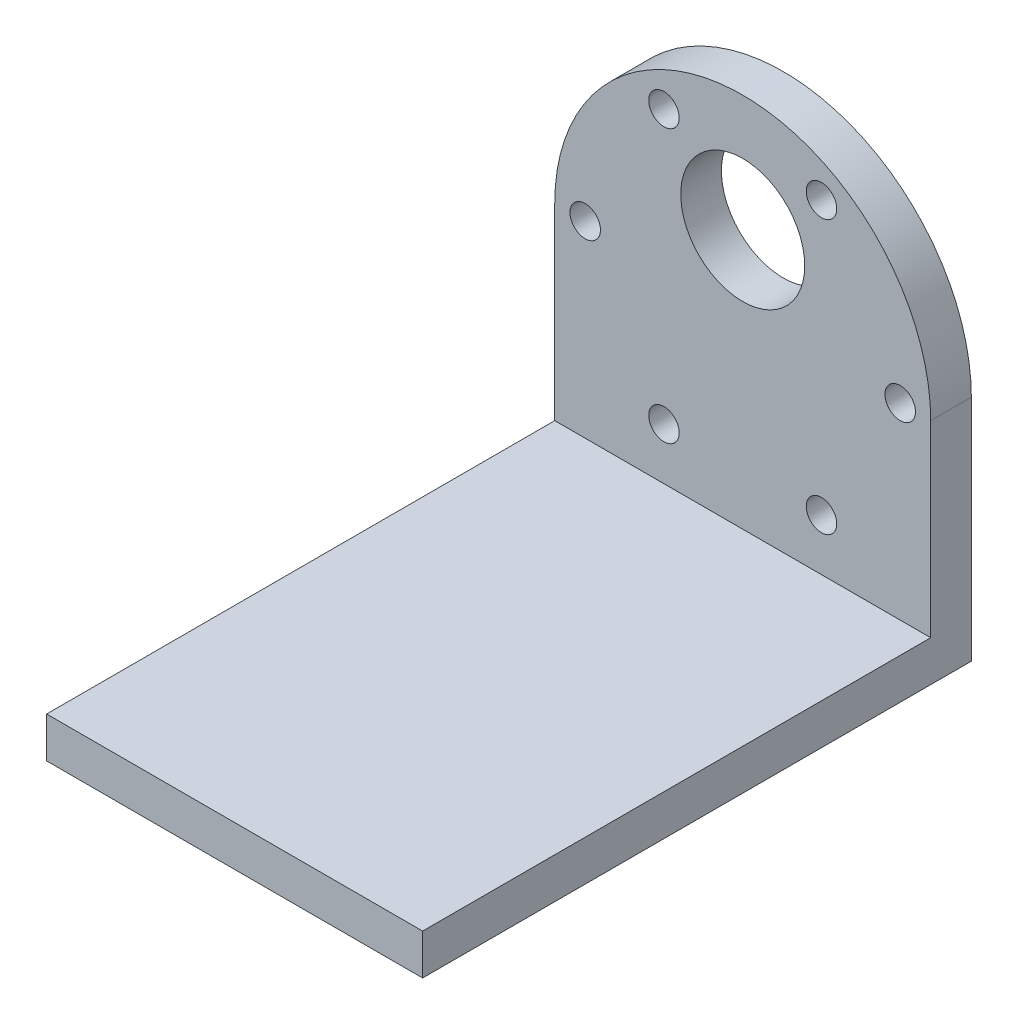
ISO-10303-21;
HEADER;
FILE_DESCRIPTION(('STEP AP214'),'2;1');
FILE_NAME('part.step','',(''),(''),'','','');
FILE_SCHEMA(('AUTOMOTIVE_DESIGN { 1 0 10303 214 1 1 1 1 }'));
ENDSEC;
DATA;
#1=APPLICATION_CONTEXT('core data for automotive mechanical design processes');
#2=APPLICATION_PROTOCOL_DEFINITION('international standard','automotive_design',2000,#1);
#3=PRODUCT_CONTEXT('',#1,'mechanical');
#4=PRODUCT('Part','Part','',(#3));
#5=PRODUCT_RELATED_PRODUCT_CATEGORY('part','',(#4));
#6=PRODUCT_DEFINITION_FORMATION('','',#4);
#7=PRODUCT_DEFINITION_CONTEXT('part definition',#1,'design');
#8=PRODUCT_DEFINITION('design','',#6,#7);
#9=PRODUCT_DEFINITION_SHAPE('','',#8);
#10=(LENGTH_UNIT() NAMED_UNIT(*) SI_UNIT(.MILLI.,.METRE.));
#11=(NAMED_UNIT(*) PLANE_ANGLE_UNIT() SI_UNIT($,.RADIAN.));
#12=(NAMED_UNIT(*) SI_UNIT($,.STERADIAN.) SOLID_ANGLE_UNIT());
#13=UNCERTAINTY_MEASURE_WITH_UNIT(LENGTH_MEASURE(1.E-05),#10,'distance_accuracy_value','');
#14=(GEOMETRIC_REPRESENTATION_CONTEXT(3) GLOBAL_UNCERTAINTY_ASSIGNED_CONTEXT((#13)) GLOBAL_UNIT_ASSIGNED_CONTEXT((#10,
#11,#12)) REPRESENTATION_CONTEXT('',''));
#15=CARTESIAN_POINT('',(0.,0.,0.));
#16=DIRECTION('',(0.,0.,1.));
#17=DIRECTION('',(1.,0.,0.));
#18=AXIS2_PLACEMENT_3D('',#15,#16,#17);
#19=CARTESIAN_POINT('',(18.5,22.5,4.));
#20=DIRECTION('',(0.,0.,1.));
#21=DIRECTION('',(1.,0.,0.));
#22=AXIS2_PLACEMENT_3D('',#19,#20,#21);
#23=PLANE('',#22);
#24=DIRECTION('',(-1.,0.,0.));
#25=VECTOR('',#24,1.);
#26=CARTESIAN_POINT('',(0.,4.,4.));
#27=LINE('',#26,#25);
#28=CARTESIAN_POINT('',(37.,4.,4.));
#29=VERTEX_POINT('',#28);
#30=CARTESIAN_POINT('',(0.,4.,4.));
#31=VERTEX_POINT('',#30);
#32=EDGE_CURVE('E61',#29,#31,#27,.T.);
#33=ORIENTED_EDGE('',*,*,#32,.F.);
#34=DIRECTION('',(0.,1.,0.));
#35=VECTOR('',#34,1.);
#36=CARTESIAN_POINT('',(37.,0.,4.));
#37=LINE('',#36,#35);
#38=CARTESIAN_POINT('',(37.,22.5,4.));
#39=VERTEX_POINT('',#38);
#40=EDGE_CURVE('E66',#29,#39,#37,.T.);
#41=ORIENTED_EDGE('',*,*,#40,.T.);
#42=CARTESIAN_POINT('',(18.5,22.5,4.));
#43=DIRECTION('',(0.,0.,1.));
#44=DIRECTION('',(1.,0.,0.));
#45=AXIS2_PLACEMENT_3D('',#42,#43,#44);
#46=CIRCLE('',#45,18.5);
#47=CARTESIAN_POINT('',(0.,22.5,4.));
#48=VERTEX_POINT('',#47);
#49=EDGE_CURVE('E98',#39,#48,#46,.T.);
#50=ORIENTED_EDGE('',*,*,#49,.T.);
#51=DIRECTION('',(0.,-1.,0.));
#52=VECTOR('',#51,1.);
#53=CARTESIAN_POINT('',(0.,22.5,4.));
#54=LINE('',#53,#52);
#55=EDGE_CURVE('E221',#48,#31,#54,.T.);
#56=ORIENTED_EDGE('',*,*,#55,.T.);
#57=EDGE_LOOP('',(#33,#41,#50,#56));
#58=FACE_BOUND('',#57,.T.);
#59=CARTESIAN_POINT('',(26.2500000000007,9.07660624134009,4.));
#60=DIRECTION('',(0.,0.,1.));
#61=DIRECTION('',(1.,0.,0.));
#62=AXIS2_PLACEMENT_3D('',#59,#60,#61);
#63=CIRCLE('',#62,1.50000000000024);
#64=CARTESIAN_POINT('',(27.7500000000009,9.07660624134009,4.));
#65=VERTEX_POINT('',#64);
#66=EDGE_CURVE('E178',#65,#65,#63,.T.);
#67=ORIENTED_EDGE('',*,*,#66,.F.);
#68=EDGE_LOOP('',(#67));
#69=FACE_BOUND('',#68,.T.);
#70=CARTESIAN_POINT('',(18.5,29.5,4.));
#71=DIRECTION('',(0.,0.,1.));
#72=DIRECTION('',(1.,0.,0.));
#73=AXIS2_PLACEMENT_3D('',#70,#71,#72);
#74=CIRCLE('',#73,6.1);
#75=CARTESIAN_POINT('',(24.6,29.5,4.));
#76=VERTEX_POINT('',#75);
#77=EDGE_CURVE('E194',#76,#76,#74,.T.);
#78=ORIENTED_EDGE('',*,*,#77,.F.);
#79=EDGE_LOOP('',(#78));
#80=FACE_BOUND('',#79,.T.);
#81=CARTESIAN_POINT('',(2.99999999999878,22.5,4.));
#82=DIRECTION('',(0.,0.,1.));
#83=DIRECTION('',(1.,0.,0.));
#84=AXIS2_PLACEMENT_3D('',#81,#82,#83);
#85=CIRCLE('',#84,1.50000000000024);
#86=CARTESIAN_POINT('',(4.49999999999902,22.5,4.));
#87=VERTEX_POINT('',#86);
#88=EDGE_CURVE('E210',#87,#87,#85,.T.);
#89=ORIENTED_EDGE('',*,*,#88,.F.);
#90=EDGE_LOOP('',(#89));
#91=FACE_BOUND('',#90,.T.);
#92=CARTESIAN_POINT('',(10.7499999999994,35.9233937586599,4.));
#93=DIRECTION('',(0.,0.,1.));
#94=DIRECTION('',(1.,0.,0.));
#95=AXIS2_PLACEMENT_3D('',#92,#93,#94);
#96=CIRCLE('',#95,1.50000000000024);
#97=CARTESIAN_POINT('',(12.2499999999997,35.9233937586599,4.));
#98=VERTEX_POINT('',#97);
#99=EDGE_CURVE('E111',#98,#98,#96,.T.);
#100=ORIENTED_EDGE('',*,*,#99,.F.);
#101=EDGE_LOOP('',(#100));
#102=FACE_BOUND('',#101,.T.);
#103=CARTESIAN_POINT('',(26.2500000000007,35.9233937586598,4.));
#104=DIRECTION('',(0.,0.,1.));
#105=DIRECTION('',(1.,0.,0.));
#106=AXIS2_PLACEMENT_3D('',#103,#104,#105);
#107=CIRCLE('',#106,1.50000000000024);
#108=CARTESIAN_POINT('',(27.7500000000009,35.9233937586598,4.));
#109=VERTEX_POINT('',#108);
#110=EDGE_CURVE('E202',#109,#109,#107,.T.);
#111=ORIENTED_EDGE('',*,*,#110,.F.);
#112=EDGE_LOOP('',(#111));
#113=FACE_BOUND('',#112,.T.);
#114=CARTESIAN_POINT('',(34.0000000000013,22.5,4.));
#115=DIRECTION('',(0.,0.,1.));
#116=DIRECTION('',(1.,0.,0.));
#117=AXIS2_PLACEMENT_3D('',#114,#115,#116);
#118=CIRCLE('',#117,1.50000000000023);
#119=CARTESIAN_POINT('',(35.5000000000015,22.5,4.));
#120=VERTEX_POINT('',#119);
#121=EDGE_CURVE('E186',#120,#120,#118,.T.);
#122=ORIENTED_EDGE('',*,*,#121,.F.);
#123=EDGE_LOOP('',(#122));
#124=FACE_BOUND('',#123,.T.);
#125=CARTESIAN_POINT('',(10.7499999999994,9.07660624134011,4.));
#126=DIRECTION('',(0.,0.,1.));
#127=DIRECTION('',(1.,0.,0.));
#128=AXIS2_PLACEMENT_3D('',#125,#126,#127);
#129=CIRCLE('',#128,1.50000000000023);
#130=CARTESIAN_POINT('',(12.2499999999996,9.07660624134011,4.));
#131=VERTEX_POINT('',#130);
#132=EDGE_CURVE('E170',#131,#131,#129,.T.);
#133=ORIENTED_EDGE('',*,*,#132,.F.);
#134=EDGE_LOOP('',(#133));
#135=FACE_BOUND('',#134,.T.);
#136=ADVANCED_FACE('F45',(#58,#69,#80,#91,#102,#113,#124,#135),#23,.T.);
#137=CARTESIAN_POINT('',(18.5,22.5,0.));
#138=DIRECTION('',(0.,0.,1.));
#139=DIRECTION('',(1.,0.,0.));
#140=AXIS2_PLACEMENT_3D('',#137,#138,#139);
#141=PLANE('',#140);
#142=CARTESIAN_POINT('',(18.5,22.5,0.));
#143=DIRECTION('',(0.,0.,1.));
#144=DIRECTION('',(1.,0.,0.));
#145=AXIS2_PLACEMENT_3D('',#142,#143,#144);
#146=CIRCLE('',#145,18.5);
#147=CARTESIAN_POINT('',(37.,22.5,0.));
#148=VERTEX_POINT('',#147);
#149=CARTESIAN_POINT('',(0.,22.5,0.));
#150=VERTEX_POINT('',#149);
#151=EDGE_CURVE('E104',#148,#150,#146,.T.);
#152=ORIENTED_EDGE('',*,*,#151,.F.);
#153=DIRECTION('',(0.,1.,0.));
#154=VECTOR('',#153,1.);
#155=CARTESIAN_POINT('',(37.,0.,0.));
#156=LINE('',#155,#154);
#157=CARTESIAN_POINT('',(37.,0.,0.));
#158=VERTEX_POINT('',#157);
#159=EDGE_CURVE('E86',#158,#148,#156,.T.);
#160=ORIENTED_EDGE('',*,*,#159,.F.);
#161=DIRECTION('',(1.,0.,0.));
#162=VECTOR('',#161,1.);
#163=CARTESIAN_POINT('',(0.,0.,0.));
#164=LINE('',#163,#162);
#165=CARTESIAN_POINT('',(0.,0.,0.));
#166=VERTEX_POINT('',#165);
#167=EDGE_CURVE('E99',#166,#158,#164,.T.);
#168=ORIENTED_EDGE('',*,*,#167,.F.);
#169=DIRECTION('',(0.,-1.,0.));
#170=VECTOR('',#169,1.);
#171=CARTESIAN_POINT('',(0.,22.5,0.));
#172=LINE('',#171,#170);
#173=EDGE_CURVE('E109',#150,#166,#172,.T.);
#174=ORIENTED_EDGE('',*,*,#173,.F.);
#175=EDGE_LOOP('',(#152,#160,#168,#174));
#176=FACE_BOUND('',#175,.T.);
#177=CARTESIAN_POINT('',(10.7499999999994,35.9233937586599,0.));
#178=DIRECTION('',(0.,0.,1.));
#179=DIRECTION('',(1.,0.,0.));
#180=AXIS2_PLACEMENT_3D('',#177,#178,#179);
#181=CIRCLE('',#180,1.50000000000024);
#182=CARTESIAN_POINT('',(12.2499999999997,35.9233937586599,0.));
#183=VERTEX_POINT('',#182);
#184=EDGE_CURVE('E117',#183,#183,#181,.T.);
#185=ORIENTED_EDGE('',*,*,#184,.T.);
#186=EDGE_LOOP('',(#185));
#187=FACE_BOUND('',#186,.T.);
#188=CARTESIAN_POINT('',(2.99999999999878,22.5,0.));
#189=DIRECTION('',(0.,0.,1.));
#190=DIRECTION('',(1.,0.,0.));
#191=AXIS2_PLACEMENT_3D('',#188,#189,#190);
#192=CIRCLE('',#191,1.50000000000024);
#193=CARTESIAN_POINT('',(4.49999999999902,22.5,0.));
#194=VERTEX_POINT('',#193);
#195=EDGE_CURVE('E206',#194,#194,#192,.T.);
#196=ORIENTED_EDGE('',*,*,#195,.T.);
#197=EDGE_LOOP('',(#196));
#198=FACE_BOUND('',#197,.T.);
#199=CARTESIAN_POINT('',(26.2500000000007,35.9233937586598,0.));
#200=DIRECTION('',(0.,0.,1.));
#201=DIRECTION('',(1.,0.,0.));
#202=AXIS2_PLACEMENT_3D('',#199,#200,#201);
#203=CIRCLE('',#202,1.50000000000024);
#204=CARTESIAN_POINT('',(27.7500000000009,35.9233937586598,0.));
#205=VERTEX_POINT('',#204);
#206=EDGE_CURVE('E198',#205,#205,#203,.T.);
#207=ORIENTED_EDGE('',*,*,#206,.T.);
#208=EDGE_LOOP('',(#207));
#209=FACE_BOUND('',#208,.T.);
#210=CARTESIAN_POINT('',(18.5,29.5,0.));
#211=DIRECTION('',(0.,0.,1.));
#212=DIRECTION('',(1.,0.,0.));
#213=AXIS2_PLACEMENT_3D('',#210,#211,#212);
#214=CIRCLE('',#213,6.1);
#215=CARTESIAN_POINT('',(24.6,29.5,0.));
#216=VERTEX_POINT('',#215);
#217=EDGE_CURVE('E190',#216,#216,#214,.T.);
#218=ORIENTED_EDGE('',*,*,#217,.T.);
#219=EDGE_LOOP('',(#218));
#220=FACE_BOUND('',#219,.T.);
#221=CARTESIAN_POINT('',(34.0000000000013,22.5,0.));
#222=DIRECTION('',(0.,0.,1.));
#223=DIRECTION('',(1.,0.,0.));
#224=AXIS2_PLACEMENT_3D('',#221,#222,#223);
#225=CIRCLE('',#224,1.50000000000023);
#226=CARTESIAN_POINT('',(35.5000000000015,22.5,0.));
#227=VERTEX_POINT('',#226);
#228=EDGE_CURVE('E182',#227,#227,#225,.T.);
#229=ORIENTED_EDGE('',*,*,#228,.T.);
#230=EDGE_LOOP('',(#229));
#231=FACE_BOUND('',#230,.T.);
#232=CARTESIAN_POINT('',(26.2500000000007,9.07660624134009,0.));
#233=DIRECTION('',(0.,0.,1.));
#234=DIRECTION('',(1.,0.,0.));
#235=AXIS2_PLACEMENT_3D('',#232,#233,#234);
#236=CIRCLE('',#235,1.50000000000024);
#237=CARTESIAN_POINT('',(27.7500000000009,9.07660624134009,0.));
#238=VERTEX_POINT('',#237);
#239=EDGE_CURVE('E174',#238,#238,#236,.T.);
#240=ORIENTED_EDGE('',*,*,#239,.T.);
#241=EDGE_LOOP('',(#240));
#242=FACE_BOUND('',#241,.T.);
#243=CARTESIAN_POINT('',(10.7499999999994,9.07660624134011,0.));
#244=DIRECTION('',(0.,0.,1.));
#245=DIRECTION('',(1.,0.,0.));
#246=AXIS2_PLACEMENT_3D('',#243,#244,#245);
#247=CIRCLE('',#246,1.50000000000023);
#248=CARTESIAN_POINT('',(12.2499999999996,9.07660624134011,0.));
#249=VERTEX_POINT('',#248);
#250=EDGE_CURVE('E166',#249,#249,#247,.T.);
#251=ORIENTED_EDGE('',*,*,#250,.T.);
#252=EDGE_LOOP('',(#251));
#253=FACE_BOUND('',#252,.T.);
#254=ADVANCED_FACE('F107',(#176,#187,#198,#209,#220,#231,#242,#253),#141,.F.);
#255=CARTESIAN_POINT('',(18.5,22.5,4.));
#256=DIRECTION('',(0.,0.,-1.));
#257=DIRECTION('',(-1.,0.,0.));
#258=AXIS2_PLACEMENT_3D('',#255,#256,#257);
#259=CYLINDRICAL_SURFACE('',#258,18.5);
#260=ORIENTED_EDGE('',*,*,#151,.T.);
#261=DIRECTION('',(0.,0.,-1.));
#262=VECTOR('',#261,1.);
#263=CARTESIAN_POINT('',(0.,22.5,4.));
#264=LINE('',#263,#262);
#265=EDGE_CURVE('E11',#48,#150,#264,.T.);
#266=ORIENTED_EDGE('',*,*,#265,.F.);
#267=ORIENTED_EDGE('',*,*,#49,.F.);
#268=DIRECTION('',(0.,0.,-1.));
#269=VECTOR('',#268,1.);
#270=CARTESIAN_POINT('',(37.,22.5,4.));
#271=LINE('',#270,#269);
#272=EDGE_CURVE('E89',#39,#148,#271,.T.);
#273=ORIENTED_EDGE('',*,*,#272,.T.);
#274=EDGE_LOOP('',(#260,#266,#267,#273));
#275=FACE_BOUND('',#274,.T.);
#276=ADVANCED_FACE('F47',(#275),#259,.T.);
#277=CARTESIAN_POINT('',(0.,22.5,4.));
#278=DIRECTION('',(1.,0.,0.));
#279=DIRECTION('',(0.,1.,0.));
#280=AXIS2_PLACEMENT_3D('',#277,#278,#279);
#281=PLANE('',#280);
#282=ORIENTED_EDGE('',*,*,#173,.T.);
#283=DIRECTION('',(0.,0.,-1.));
#284=VECTOR('',#283,1.);
#285=CARTESIAN_POINT('',(0.,0.,4.));
#286=LINE('',#285,#284);
#287=CARTESIAN_POINT('',(0.,0.,54.));
#288=VERTEX_POINT('',#287);
#289=EDGE_CURVE('E54',#288,#166,#286,.T.);
#290=ORIENTED_EDGE('',*,*,#289,.F.);
#291=DIRECTION('',(0.,-1.,0.));
#292=VECTOR('',#291,1.);
#293=CARTESIAN_POINT('',(0.,0.,54.));
#294=LINE('',#293,#292);
#295=CARTESIAN_POINT('',(0.,4.,54.));
#296=VERTEX_POINT('',#295);
#297=EDGE_CURVE('E139',#296,#288,#294,.T.);
#298=ORIENTED_EDGE('',*,*,#297,.F.);
#299=DIRECTION('',(0.,0.,-1.));
#300=VECTOR('',#299,1.);
#301=CARTESIAN_POINT('',(0.,4.,54.));
#302=LINE('',#301,#300);
#303=EDGE_CURVE('E159',#296,#31,#302,.T.);
#304=ORIENTED_EDGE('',*,*,#303,.T.);
#305=ORIENTED_EDGE('',*,*,#55,.F.);
#306=ORIENTED_EDGE('',*,*,#265,.T.);
#307=EDGE_LOOP('',(#282,#290,#298,#304,#305,#306));
#308=FACE_BOUND('',#307,.T.);
#309=ADVANCED_FACE('F137',(#308),#281,.F.);
#310=CARTESIAN_POINT('',(0.,0.,4.));
#311=DIRECTION('',(0.,1.,0.));
#312=DIRECTION('',(0.,0.,1.));
#313=AXIS2_PLACEMENT_3D('',#310,#311,#312);
#314=PLANE('',#313);
#315=ORIENTED_EDGE('',*,*,#167,.T.);
#316=DIRECTION('',(0.,0.,-1.));
#317=VECTOR('',#316,1.);
#318=CARTESIAN_POINT('',(37.,0.,4.));
#319=LINE('',#318,#317);
#320=CARTESIAN_POINT('',(37.,0.,54.));
#321=VERTEX_POINT('',#320);
#322=EDGE_CURVE('E93',#321,#158,#319,.T.);
#323=ORIENTED_EDGE('',*,*,#322,.F.);
#324=DIRECTION('',(1.,0.,0.));
#325=VECTOR('',#324,1.);
#326=CARTESIAN_POINT('',(0.,0.,54.));
#327=LINE('',#326,#325);
#328=EDGE_CURVE('E133',#288,#321,#327,.T.);
#329=ORIENTED_EDGE('',*,*,#328,.F.);
#330=ORIENTED_EDGE('',*,*,#289,.T.);
#331=EDGE_LOOP('',(#315,#323,#329,#330));
#332=FACE_BOUND('',#331,.T.);
#333=ADVANCED_FACE('F130',(#332),#314,.F.);
#334=CARTESIAN_POINT('',(37.,0.,4.));
#335=DIRECTION('',(-1.,0.,0.));
#336=DIRECTION('',(0.,-1.,0.));
#337=AXIS2_PLACEMENT_3D('',#334,#335,#336);
#338=PLANE('',#337);
#339=ORIENTED_EDGE('',*,*,#159,.T.);
#340=ORIENTED_EDGE('',*,*,#272,.F.);
#341=ORIENTED_EDGE('',*,*,#40,.F.);
#342=DIRECTION('',(0.,0.,-1.));
#343=VECTOR('',#342,1.);
#344=CARTESIAN_POINT('',(37.,4.,54.));
#345=LINE('',#344,#343);
#346=CARTESIAN_POINT('',(37.,4.,54.));
#347=VERTEX_POINT('',#346);
#348=EDGE_CURVE('E163',#347,#29,#345,.T.);
#349=ORIENTED_EDGE('',*,*,#348,.F.);
#350=DIRECTION('',(0.,1.,0.));
#351=VECTOR('',#350,1.);
#352=CARTESIAN_POINT('',(37.,0.,54.));
#353=LINE('',#352,#351);
#354=EDGE_CURVE('E154',#321,#347,#353,.T.);
#355=ORIENTED_EDGE('',*,*,#354,.F.);
#356=ORIENTED_EDGE('',*,*,#322,.T.);
#357=EDGE_LOOP('',(#339,#340,#341,#349,#355,#356));
#358=FACE_BOUND('',#357,.T.);
#359=ADVANCED_FACE('F88',(#358),#338,.F.);
#360=CARTESIAN_POINT('',(10.7499999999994,35.9233937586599,4.));
#361=DIRECTION('',(0.,0.,-1.));
#362=DIRECTION('',(-1.,0.,0.));
#363=AXIS2_PLACEMENT_3D('',#360,#361,#362);
#364=CYLINDRICAL_SURFACE('',#363,1.50000000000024);
#365=ORIENTED_EDGE('',*,*,#99,.T.);
#366=EDGE_LOOP('',(#365));
#367=FACE_BOUND('',#366,.T.);
#368=ORIENTED_EDGE('',*,*,#184,.F.);
#369=EDGE_LOOP('',(#368));
#370=FACE_BOUND('',#369,.T.);
#371=ADVANCED_FACE('F257',(#367,#370),#364,.F.);
#372=CARTESIAN_POINT('',(2.99999999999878,22.5,4.));
#373=DIRECTION('',(0.,0.,-1.));
#374=DIRECTION('',(-1.,0.,0.));
#375=AXIS2_PLACEMENT_3D('',#372,#373,#374);
#376=CYLINDRICAL_SURFACE('',#375,1.50000000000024);
#377=ORIENTED_EDGE('',*,*,#88,.T.);
#378=EDGE_LOOP('',(#377));
#379=FACE_BOUND('',#378,.T.);
#380=ORIENTED_EDGE('',*,*,#195,.F.);
#381=EDGE_LOOP('',(#380));
#382=FACE_BOUND('',#381,.T.);
#383=ADVANCED_FACE('F330',(#379,#382),#376,.F.);
#384=CARTESIAN_POINT('',(26.2500000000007,35.9233937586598,4.));
#385=DIRECTION('',(0.,0.,-1.));
#386=DIRECTION('',(-1.,0.,0.));
#387=AXIS2_PLACEMENT_3D('',#384,#385,#386);
#388=CYLINDRICAL_SURFACE('',#387,1.50000000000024);
#389=ORIENTED_EDGE('',*,*,#110,.T.);
#390=EDGE_LOOP('',(#389));
#391=FACE_BOUND('',#390,.T.);
#392=ORIENTED_EDGE('',*,*,#206,.F.);
#393=EDGE_LOOP('',(#392));
#394=FACE_BOUND('',#393,.T.);
#395=ADVANCED_FACE('F321',(#391,#394),#388,.F.);
#396=CARTESIAN_POINT('',(18.5,29.5,4.));
#397=DIRECTION('',(0.,0.,-1.));
#398=DIRECTION('',(-1.,0.,0.));
#399=AXIS2_PLACEMENT_3D('',#396,#397,#398);
#400=CYLINDRICAL_SURFACE('',#399,6.1);
#401=ORIENTED_EDGE('',*,*,#77,.T.);
#402=EDGE_LOOP('',(#401));
#403=FACE_BOUND('',#402,.T.);
#404=ORIENTED_EDGE('',*,*,#217,.F.);
#405=EDGE_LOOP('',(#404));
#406=FACE_BOUND('',#405,.T.);
#407=ADVANCED_FACE('F312',(#403,#406),#400,.F.);
#408=CARTESIAN_POINT('',(34.0000000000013,22.5,4.));
#409=DIRECTION('',(0.,0.,-1.));
#410=DIRECTION('',(-1.,0.,0.));
#411=AXIS2_PLACEMENT_3D('',#408,#409,#410);
#412=CYLINDRICAL_SURFACE('',#411,1.50000000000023);
#413=ORIENTED_EDGE('',*,*,#121,.T.);
#414=EDGE_LOOP('',(#413));
#415=FACE_BOUND('',#414,.T.);
#416=ORIENTED_EDGE('',*,*,#228,.F.);
#417=EDGE_LOOP('',(#416));
#418=FACE_BOUND('',#417,.T.);
#419=ADVANCED_FACE('F303',(#415,#418),#412,.F.);
#420=CARTESIAN_POINT('',(26.2500000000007,9.07660624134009,4.));
#421=DIRECTION('',(0.,0.,-1.));
#422=DIRECTION('',(-1.,0.,0.));
#423=AXIS2_PLACEMENT_3D('',#420,#421,#422);
#424=CYLINDRICAL_SURFACE('',#423,1.50000000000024);
#425=ORIENTED_EDGE('',*,*,#66,.T.);
#426=EDGE_LOOP('',(#425));
#427=FACE_BOUND('',#426,.T.);
#428=ORIENTED_EDGE('',*,*,#239,.F.);
#429=EDGE_LOOP('',(#428));
#430=FACE_BOUND('',#429,.T.);
#431=ADVANCED_FACE('F244',(#427,#430),#424,.F.);
#432=CARTESIAN_POINT('',(10.7499999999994,9.07660624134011,4.));
#433=DIRECTION('',(0.,0.,-1.));
#434=DIRECTION('',(-1.,0.,0.));
#435=AXIS2_PLACEMENT_3D('',#432,#433,#434);
#436=CYLINDRICAL_SURFACE('',#435,1.50000000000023);
#437=ORIENTED_EDGE('',*,*,#132,.T.);
#438=EDGE_LOOP('',(#437));
#439=FACE_BOUND('',#438,.T.);
#440=ORIENTED_EDGE('',*,*,#250,.F.);
#441=EDGE_LOOP('',(#440));
#442=FACE_BOUND('',#441,.T.);
#443=ADVANCED_FACE('F241',(#439,#442),#436,.F.);
#444=CARTESIAN_POINT('',(0.,4.,54.));
#445=DIRECTION('',(0.,-1.,0.));
#446=DIRECTION('',(0.,0.,-1.));
#447=AXIS2_PLACEMENT_3D('',#444,#445,#446);
#448=PLANE('',#447);
#449=ORIENTED_EDGE('',*,*,#32,.T.);
#450=ORIENTED_EDGE('',*,*,#303,.F.);
#451=DIRECTION('',(-1.,0.,0.));
#452=VECTOR('',#451,1.);
#453=CARTESIAN_POINT('',(0.,4.,54.));
#454=LINE('',#453,#452);
#455=EDGE_CURVE('E151',#347,#296,#454,.T.);
#456=ORIENTED_EDGE('',*,*,#455,.F.);
#457=ORIENTED_EDGE('',*,*,#348,.T.);
#458=EDGE_LOOP('',(#449,#450,#456,#457));
#459=FACE_BOUND('',#458,.T.);
#460=ADVANCED_FACE('F161',(#459),#448,.F.);
#461=CARTESIAN_POINT('',(0.,0.,54.));
#462=DIRECTION('',(0.,0.,-1.));
#463=DIRECTION('',(-1.,0.,0.));
#464=AXIS2_PLACEMENT_3D('',#461,#462,#463);
#465=PLANE('',#464);
#466=ORIENTED_EDGE('',*,*,#297,.T.);
#467=ORIENTED_EDGE('',*,*,#328,.T.);
#468=ORIENTED_EDGE('',*,*,#354,.T.);
#469=ORIENTED_EDGE('',*,*,#455,.T.);
#470=EDGE_LOOP('',(#466,#467,#468,#469));
#471=FACE_BOUND('',#470,.T.);
#472=ADVANCED_FACE('F153',(#471),#465,.F.);
#473=CLOSED_SHELL('',(#136,#254,#276,#309,#333,#359,#371,#383,#395,#407,#419,#431,#443,#460,#472));
#474=MANIFOLD_SOLID_BREP('B2',#473);
#475=ADVANCED_BREP_SHAPE_REPRESENTATION('',(#18,#474),#14);
#476=SHAPE_DEFINITION_REPRESENTATION(#9,#475);
ENDSEC;
END-ISO-10303-21;
